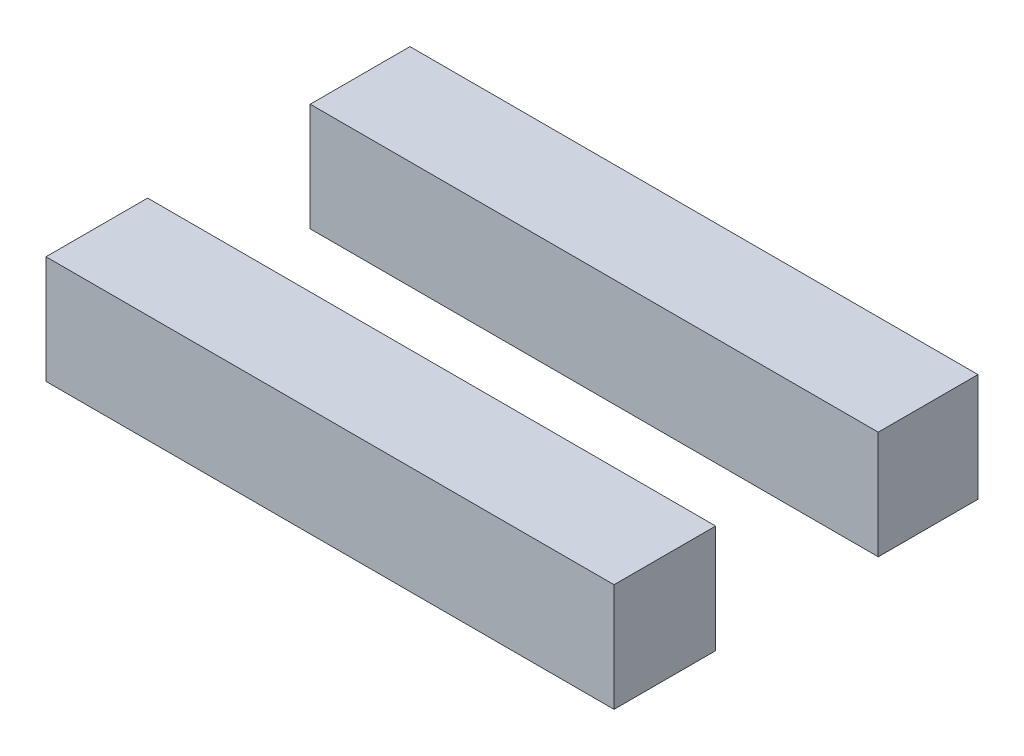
ISO-10303-21;
HEADER;
FILE_DESCRIPTION(('STEP AP214'),'2;1');
FILE_NAME('part.step','',(''),(''),'','','');
FILE_SCHEMA(('AUTOMOTIVE_DESIGN { 1 0 10303 214 1 1 1 1 }'));
ENDSEC;
DATA;
#1=APPLICATION_CONTEXT('core data for automotive mechanical design processes');
#2=APPLICATION_PROTOCOL_DEFINITION('international standard','automotive_design',2000,#1);
#3=PRODUCT_CONTEXT('',#1,'mechanical');
#4=PRODUCT('Part','Part','',(#3));
#5=PRODUCT_RELATED_PRODUCT_CATEGORY('part','',(#4));
#6=PRODUCT_DEFINITION_FORMATION('','',#4);
#7=PRODUCT_DEFINITION_CONTEXT('part definition',#1,'design');
#8=PRODUCT_DEFINITION('design','',#6,#7);
#9=PRODUCT_DEFINITION_SHAPE('','',#8);
#10=(LENGTH_UNIT() NAMED_UNIT(*) SI_UNIT(.MILLI.,.METRE.));
#11=(NAMED_UNIT(*) PLANE_ANGLE_UNIT() SI_UNIT($,.RADIAN.));
#12=(NAMED_UNIT(*) SI_UNIT($,.STERADIAN.) SOLID_ANGLE_UNIT());
#13=UNCERTAINTY_MEASURE_WITH_UNIT(LENGTH_MEASURE(1.E-05),#10,'distance_accuracy_value','');
#14=(GEOMETRIC_REPRESENTATION_CONTEXT(3) GLOBAL_UNCERTAINTY_ASSIGNED_CONTEXT((#13)) GLOBAL_UNIT_ASSIGNED_CONTEXT((#10,
#11,#12)) REPRESENTATION_CONTEXT('',''));
#15=CARTESIAN_POINT('',(0.,0.,0.));
#16=DIRECTION('',(0.,0.,1.));
#17=DIRECTION('',(1.,0.,0.));
#18=AXIS2_PLACEMENT_3D('',#15,#16,#17);
#19=CARTESIAN_POINT('',(-86.7956107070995,33.,-55.6146576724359));
#20=DIRECTION('',(1.,0.,0.));
#21=DIRECTION('',(0.,0.,-1.));
#22=AXIS2_PLACEMENT_3D('',#19,#20,#21);
#23=PLANE('',#22);
#24=DIRECTION('',(0.,0.,1.));
#25=VECTOR('',#24,1.);
#26=CARTESIAN_POINT('',(-86.7956107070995,33.,-55.6146576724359));
#27=LINE('',#26,#25);
#28=CARTESIAN_POINT('',(-86.7956107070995,33.,24.5587371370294));
#29=VERTEX_POINT('',#28);
#30=CARTESIAN_POINT('',(-86.7956107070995,33.,55.6146576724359));
#31=VERTEX_POINT('',#30);
#32=EDGE_CURVE('E86',#29,#31,#27,.T.);
#33=ORIENTED_EDGE('',*,*,#32,.F.);
#34=DIRECTION('',(0.,-1.,0.));
#35=VECTOR('',#34,1.);
#36=CARTESIAN_POINT('',(-86.7956107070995,33.,24.5587371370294));
#37=LINE('',#36,#35);
#38=CARTESIAN_POINT('',(-86.7956107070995,0.,24.5587371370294));
#39=VERTEX_POINT('',#38);
#40=EDGE_CURVE('E57',#29,#39,#37,.T.);
#41=ORIENTED_EDGE('',*,*,#40,.T.);
#42=DIRECTION('',(0.,0.,1.));
#43=VECTOR('',#42,1.);
#44=CARTESIAN_POINT('',(-86.7956107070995,0.,-55.6146576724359));
#45=LINE('',#44,#43);
#46=CARTESIAN_POINT('',(-86.7956107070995,0.,55.6146576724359));
#47=VERTEX_POINT('',#46);
#48=EDGE_CURVE('E45',#39,#47,#45,.T.);
#49=ORIENTED_EDGE('',*,*,#48,.T.);
#50=DIRECTION('',(0.,-1.,0.));
#51=VECTOR('',#50,1.);
#52=CARTESIAN_POINT('',(-86.7956107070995,33.,55.6146576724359));
#53=LINE('',#52,#51);
#54=EDGE_CURVE('E50',#31,#47,#53,.T.);
#55=ORIENTED_EDGE('',*,*,#54,.F.);
#56=EDGE_LOOP('',(#33,#41,#49,#55));
#57=FACE_BOUND('',#56,.T.);
#58=ADVANCED_FACE('F42',(#57),#23,.F.);
#59=CARTESIAN_POINT('',(86.7956107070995,33.,-55.6146576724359));
#60=DIRECTION('',(-1.,0.,0.));
#61=DIRECTION('',(0.,0.,1.));
#62=AXIS2_PLACEMENT_3D('',#59,#60,#61);
#63=PLANE('',#62);
#64=DIRECTION('',(0.,0.,-1.));
#65=VECTOR('',#64,1.);
#66=CARTESIAN_POINT('',(86.7956107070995,0.,-55.6146576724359));
#67=LINE('',#66,#65);
#68=CARTESIAN_POINT('',(86.7956107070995,0.,55.6146576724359));
#69=VERTEX_POINT('',#68);
#70=CARTESIAN_POINT('',(86.7956107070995,0.,24.5587371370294));
#71=VERTEX_POINT('',#70);
#72=EDGE_CURVE('E93',#69,#71,#67,.T.);
#73=ORIENTED_EDGE('',*,*,#72,.T.);
#74=DIRECTION('',(0.,1.,0.));
#75=VECTOR('',#74,1.);
#76=CARTESIAN_POINT('',(86.7956107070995,33.,24.5587371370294));
#77=LINE('',#76,#75);
#78=CARTESIAN_POINT('',(86.7956107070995,33.,24.5587371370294));
#79=VERTEX_POINT('',#78);
#80=EDGE_CURVE('E105',#71,#79,#77,.T.);
#81=ORIENTED_EDGE('',*,*,#80,.T.);
#82=DIRECTION('',(0.,0.,-1.));
#83=VECTOR('',#82,1.);
#84=CARTESIAN_POINT('',(86.7956107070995,33.,-55.6146576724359));
#85=LINE('',#84,#83);
#86=CARTESIAN_POINT('',(86.7956107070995,33.,55.6146576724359));
#87=VERTEX_POINT('',#86);
#88=EDGE_CURVE('E106',#87,#79,#85,.T.);
#89=ORIENTED_EDGE('',*,*,#88,.F.);
#90=DIRECTION('',(0.,-1.,0.));
#91=VECTOR('',#90,1.);
#92=CARTESIAN_POINT('',(86.7956107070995,33.,55.6146576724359));
#93=LINE('',#92,#91);
#94=EDGE_CURVE('E103',#87,#69,#93,.T.);
#95=ORIENTED_EDGE('',*,*,#94,.T.);
#96=EDGE_LOOP('',(#73,#81,#89,#95));
#97=FACE_BOUND('',#96,.T.);
#98=ADVANCED_FACE('F113',(#97),#63,.F.);
#99=CARTESIAN_POINT('',(-86.7956107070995,33.,55.6146576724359));
#100=DIRECTION('',(0.,1.,0.));
#101=DIRECTION('',(0.,0.,1.));
#102=AXIS2_PLACEMENT_3D('',#99,#100,#101);
#103=PLANE('',#102);
#104=DIRECTION('',(1.,0.,0.));
#105=VECTOR('',#104,1.);
#106=CARTESIAN_POINT('',(95.379281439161,33.,24.5587371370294));
#107=LINE('',#106,#105);
#108=EDGE_CURVE('E12',#29,#79,#107,.T.);
#109=ORIENTED_EDGE('',*,*,#108,.F.);
#110=ORIENTED_EDGE('',*,*,#32,.T.);
#111=DIRECTION('',(1.,0.,0.));
#112=VECTOR('',#111,1.);
#113=CARTESIAN_POINT('',(-86.7956107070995,33.,55.6146576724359));
#114=LINE('',#113,#112);
#115=EDGE_CURVE('E99',#31,#87,#114,.T.);
#116=ORIENTED_EDGE('',*,*,#115,.T.);
#117=ORIENTED_EDGE('',*,*,#88,.T.);
#118=EDGE_LOOP('',(#109,#110,#116,#117));
#119=FACE_BOUND('',#118,.T.);
#120=ADVANCED_FACE('F115',(#119),#103,.T.);
#121=CARTESIAN_POINT('',(-86.7956107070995,0.,55.6146576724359));
#122=DIRECTION('',(0.,1.,0.));
#123=DIRECTION('',(0.,0.,1.));
#124=AXIS2_PLACEMENT_3D('',#121,#122,#123);
#125=PLANE('',#124);
#126=ORIENTED_EDGE('',*,*,#48,.F.);
#127=DIRECTION('',(1.,0.,0.));
#128=VECTOR('',#127,1.);
#129=CARTESIAN_POINT('',(-86.7956107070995,0.,24.5587371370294));
#130=LINE('',#129,#128);
#131=EDGE_CURVE('E63',#39,#71,#130,.T.);
#132=ORIENTED_EDGE('',*,*,#131,.T.);
#133=ORIENTED_EDGE('',*,*,#72,.F.);
#134=DIRECTION('',(1.,0.,0.));
#135=VECTOR('',#134,1.);
#136=CARTESIAN_POINT('',(-86.7956107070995,0.,55.6146576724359));
#137=LINE('',#136,#135);
#138=EDGE_CURVE('E77',#47,#69,#137,.T.);
#139=ORIENTED_EDGE('',*,*,#138,.F.);
#140=EDGE_LOOP('',(#126,#132,#133,#139));
#141=FACE_BOUND('',#140,.T.);
#142=ADVANCED_FACE('F95',(#141),#125,.F.);
#143=CARTESIAN_POINT('',(-86.7956107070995,33.,55.6146576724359));
#144=DIRECTION('',(0.,0.,-1.));
#145=DIRECTION('',(-1.,0.,0.));
#146=AXIS2_PLACEMENT_3D('',#143,#144,#145);
#147=PLANE('',#146);
#148=ORIENTED_EDGE('',*,*,#138,.T.);
#149=ORIENTED_EDGE('',*,*,#94,.F.);
#150=ORIENTED_EDGE('',*,*,#115,.F.);
#151=ORIENTED_EDGE('',*,*,#54,.T.);
#152=EDGE_LOOP('',(#148,#149,#150,#151));
#153=FACE_BOUND('',#152,.T.);
#154=ADVANCED_FACE('F98',(#153),#147,.F.);
#155=CARTESIAN_POINT('',(95.379281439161,0.,24.5587371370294));
#156=DIRECTION('',(0.,0.,1.));
#157=DIRECTION('',(1.,0.,0.));
#158=AXIS2_PLACEMENT_3D('',#155,#156,#157);
#159=PLANE('',#158);
#160=ORIENTED_EDGE('',*,*,#108,.T.);
#161=ORIENTED_EDGE('',*,*,#80,.F.);
#162=ORIENTED_EDGE('',*,*,#131,.F.);
#163=ORIENTED_EDGE('',*,*,#40,.F.);
#164=EDGE_LOOP('',(#160,#161,#162,#163));
#165=FACE_BOUND('',#164,.T.);
#166=ADVANCED_FACE('F149',(#165),#159,.F.);
#167=CLOSED_SHELL('',(#58,#98,#120,#142,#154,#166));
#168=MANIFOLD_SOLID_BREP('B2',#167);
#169=CARTESIAN_POINT('',(-86.7956107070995,33.,-55.6146576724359));
#170=DIRECTION('',(0.,0.,1.));
#171=DIRECTION('',(1.,0.,0.));
#172=AXIS2_PLACEMENT_3D('',#169,#170,#171);
#173=PLANE('',#172);
#174=DIRECTION('',(-1.,0.,0.));
#175=VECTOR('',#174,1.);
#176=CARTESIAN_POINT('',(-86.7956107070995,0.,-55.6146576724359));
#177=LINE('',#176,#175);
#178=CARTESIAN_POINT('',(86.7956107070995,0.,-55.6146576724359));
#179=VERTEX_POINT('',#178);
#180=CARTESIAN_POINT('',(-86.7956107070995,0.,-55.6146576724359));
#181=VERTEX_POINT('',#180);
#182=EDGE_CURVE('E223',#179,#181,#177,.T.);
#183=ORIENTED_EDGE('',*,*,#182,.T.);
#184=DIRECTION('',(0.,-1.,0.));
#185=VECTOR('',#184,1.);
#186=CARTESIAN_POINT('',(-86.7956107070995,33.,-55.6146576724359));
#187=LINE('',#186,#185);
#188=CARTESIAN_POINT('',(-86.7956107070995,33.,-55.6146576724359));
#189=VERTEX_POINT('',#188);
#190=EDGE_CURVE('E221',#189,#181,#187,.T.);
#191=ORIENTED_EDGE('',*,*,#190,.F.);
#192=DIRECTION('',(-1.,0.,0.));
#193=VECTOR('',#192,1.);
#194=CARTESIAN_POINT('',(-86.7956107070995,33.,-55.6146576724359));
#195=LINE('',#194,#193);
#196=CARTESIAN_POINT('',(86.7956107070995,33.,-55.6146576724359));
#197=VERTEX_POINT('',#196);
#198=EDGE_CURVE('E187',#197,#189,#195,.T.);
#199=ORIENTED_EDGE('',*,*,#198,.F.);
#200=DIRECTION('',(0.,-1.,0.));
#201=VECTOR('',#200,1.);
#202=CARTESIAN_POINT('',(86.7956107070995,33.,-55.6146576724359));
#203=LINE('',#202,#201);
#204=EDGE_CURVE('E173',#197,#179,#203,.T.);
#205=ORIENTED_EDGE('',*,*,#204,.T.);
#206=EDGE_LOOP('',(#183,#191,#199,#205));
#207=FACE_BOUND('',#206,.T.);
#208=ADVANCED_FACE('F165',(#207),#173,.F.);
#209=CARTESIAN_POINT('',(-86.7956107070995,0.,55.6146576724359));
#210=DIRECTION('',(0.,1.,0.));
#211=DIRECTION('',(0.,0.,1.));
#212=AXIS2_PLACEMENT_3D('',#209,#210,#211);
#213=PLANE('',#212);
#214=DIRECTION('',(0.,0.,-1.));
#215=VECTOR('',#214,1.);
#216=CARTESIAN_POINT('',(86.7956107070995,0.,-55.6146576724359));
#217=LINE('',#216,#215);
#218=CARTESIAN_POINT('',(86.7956107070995,0.,-25.1298705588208));
#219=VERTEX_POINT('',#218);
#220=EDGE_CURVE('E233',#219,#179,#217,.T.);
#221=ORIENTED_EDGE('',*,*,#220,.F.);
#222=DIRECTION('',(-1.,0.,0.));
#223=VECTOR('',#222,1.);
#224=CARTESIAN_POINT('',(-86.7956107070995,0.,-25.1298705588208));
#225=LINE('',#224,#223);
#226=CARTESIAN_POINT('',(-86.7956107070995,0.,-25.1298705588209));
#227=VERTEX_POINT('',#226);
#228=EDGE_CURVE('E40',#219,#227,#225,.T.);
#229=ORIENTED_EDGE('',*,*,#228,.T.);
#230=DIRECTION('',(0.,0.,1.));
#231=VECTOR('',#230,1.);
#232=CARTESIAN_POINT('',(-86.7956107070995,0.,-55.6146576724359));
#233=LINE('',#232,#231);
#234=EDGE_CURVE('E235',#181,#227,#233,.T.);
#235=ORIENTED_EDGE('',*,*,#234,.F.);
#236=ORIENTED_EDGE('',*,*,#182,.F.);
#237=EDGE_LOOP('',(#221,#229,#235,#236));
#238=FACE_BOUND('',#237,.T.);
#239=ADVANCED_FACE('F232',(#238),#213,.F.);
#240=CARTESIAN_POINT('',(-86.7956107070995,33.,55.6146576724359));
#241=DIRECTION('',(0.,1.,0.));
#242=DIRECTION('',(0.,0.,1.));
#243=AXIS2_PLACEMENT_3D('',#240,#241,#242);
#244=PLANE('',#243);
#245=DIRECTION('',(-1.,0.,0.));
#246=VECTOR('',#245,1.);
#247=CARTESIAN_POINT('',(95.379281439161,33.,-25.1298705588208));
#248=LINE('',#247,#246);
#249=CARTESIAN_POINT('',(86.7956107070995,33.,-25.1298705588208));
#250=VERTEX_POINT('',#249);
#251=CARTESIAN_POINT('',(-86.7956107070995,33.,-25.1298705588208));
#252=VERTEX_POINT('',#251);
#253=EDGE_CURVE('E207',#250,#252,#248,.T.);
#254=ORIENTED_EDGE('',*,*,#253,.F.);
#255=DIRECTION('',(0.,0.,-1.));
#256=VECTOR('',#255,1.);
#257=CARTESIAN_POINT('',(86.7956107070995,33.,-55.6146576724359));
#258=LINE('',#257,#256);
#259=EDGE_CURVE('E213',#250,#197,#258,.T.);
#260=ORIENTED_EDGE('',*,*,#259,.T.);
#261=ORIENTED_EDGE('',*,*,#198,.T.);
#262=DIRECTION('',(0.,0.,1.));
#263=VECTOR('',#262,1.);
#264=CARTESIAN_POINT('',(-86.7956107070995,33.,-55.6146576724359));
#265=LINE('',#264,#263);
#266=EDGE_CURVE('E216',#189,#252,#265,.T.);
#267=ORIENTED_EDGE('',*,*,#266,.T.);
#268=EDGE_LOOP('',(#254,#260,#261,#267));
#269=FACE_BOUND('',#268,.T.);
#270=ADVANCED_FACE('F212',(#269),#244,.T.);
#271=CARTESIAN_POINT('',(86.7956107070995,33.,-55.6146576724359));
#272=DIRECTION('',(-1.,0.,0.));
#273=DIRECTION('',(0.,0.,1.));
#274=AXIS2_PLACEMENT_3D('',#271,#272,#273);
#275=PLANE('',#274);
#276=ORIENTED_EDGE('',*,*,#259,.F.);
#277=DIRECTION('',(0.,-1.,0.));
#278=VECTOR('',#277,1.);
#279=CARTESIAN_POINT('',(86.7956107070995,33.,-25.1298705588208));
#280=LINE('',#279,#278);
#281=EDGE_CURVE('E204',#250,#219,#280,.T.);
#282=ORIENTED_EDGE('',*,*,#281,.T.);
#283=ORIENTED_EDGE('',*,*,#220,.T.);
#284=ORIENTED_EDGE('',*,*,#204,.F.);
#285=EDGE_LOOP('',(#276,#282,#283,#284));
#286=FACE_BOUND('',#285,.T.);
#287=ADVANCED_FACE('F218',(#286),#275,.F.);
#288=CARTESIAN_POINT('',(-86.7956107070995,33.,-55.6146576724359));
#289=DIRECTION('',(1.,0.,0.));
#290=DIRECTION('',(0.,0.,-1.));
#291=AXIS2_PLACEMENT_3D('',#288,#289,#290);
#292=PLANE('',#291);
#293=ORIENTED_EDGE('',*,*,#234,.T.);
#294=DIRECTION('',(0.,1.,0.));
#295=VECTOR('',#294,1.);
#296=CARTESIAN_POINT('',(-86.7956107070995,33.,-25.1298705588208));
#297=LINE('',#296,#295);
#298=EDGE_CURVE('E180',#227,#252,#297,.T.);
#299=ORIENTED_EDGE('',*,*,#298,.T.);
#300=ORIENTED_EDGE('',*,*,#266,.F.);
#301=ORIENTED_EDGE('',*,*,#190,.T.);
#302=EDGE_LOOP('',(#293,#299,#300,#301));
#303=FACE_BOUND('',#302,.T.);
#304=ADVANCED_FACE('F167',(#303),#292,.F.);
#305=CARTESIAN_POINT('',(95.379281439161,0.,-25.1298705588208));
#306=DIRECTION('',(0.,0.,-1.));
#307=DIRECTION('',(-1.,0.,0.));
#308=AXIS2_PLACEMENT_3D('',#305,#306,#307);
#309=PLANE('',#308);
#310=ORIENTED_EDGE('',*,*,#228,.F.);
#311=ORIENTED_EDGE('',*,*,#281,.F.);
#312=ORIENTED_EDGE('',*,*,#253,.T.);
#313=ORIENTED_EDGE('',*,*,#298,.F.);
#314=EDGE_LOOP('',(#310,#311,#312,#313));
#315=FACE_BOUND('',#314,.T.);
#316=ADVANCED_FACE('F206',(#315),#309,.F.);
#317=CLOSED_SHELL('',(#208,#239,#270,#287,#304,#316));
#318=MANIFOLD_SOLID_BREP('B6',#317);
#319=ADVANCED_BREP_SHAPE_REPRESENTATION('',(#18,#168,#318),#14);
#320=SHAPE_DEFINITION_REPRESENTATION(#9,#319);
ENDSEC;
END-ISO-10303-21;
